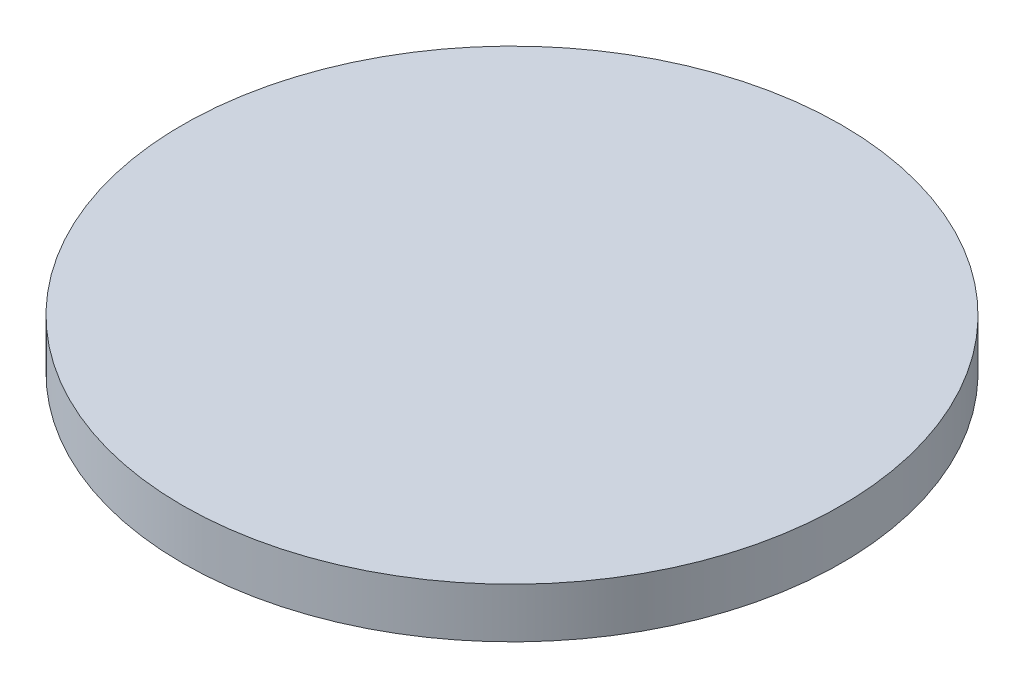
from build123d import *

# Parameters (mm, degrees)
SKETCH1_R      = 20.955
EXTRUDE1_DEPTH = 3.175


with BuildPart() as part:
    # Sketch1 → Extrude1 (new body)
    with BuildSketch(Plane(origin=(0, 0, 0), x_dir=(1, 0, 0), z_dir=(0, 1, 0))):
        with Locations(Location((0, 0, 0), (0, 0, 270))):
            Circle(SKETCH1_R)
    extrude(amount=EXTRUDE1_DEPTH)


solid = part.part
